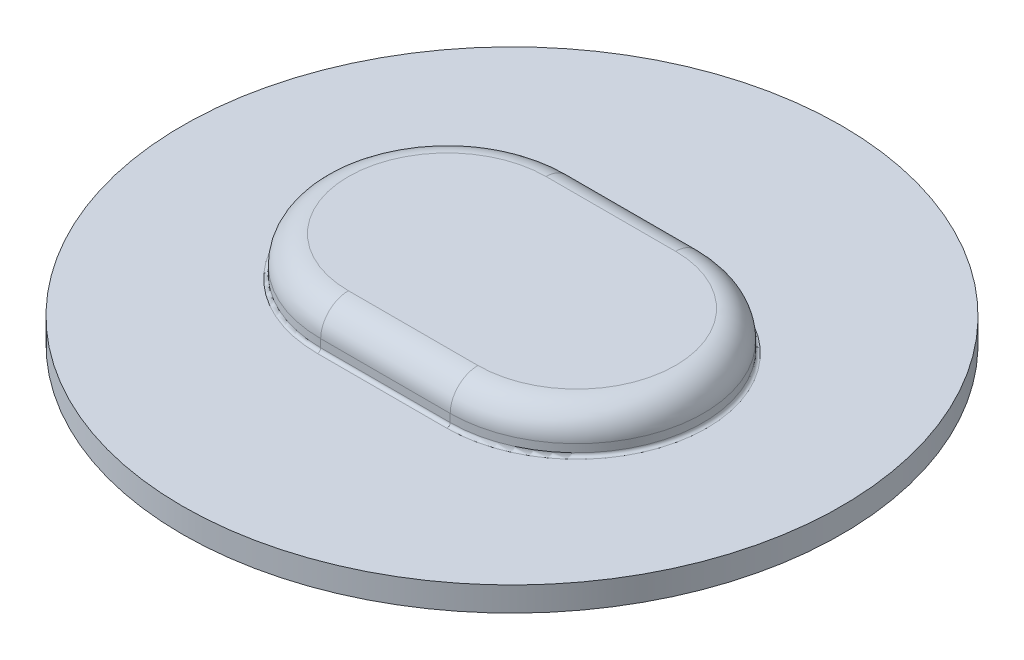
ISO-10303-21;
HEADER;
FILE_DESCRIPTION(('STEP AP214'),'2;1');
FILE_NAME('part.step','',(''),(''),'','','');
FILE_SCHEMA(('AUTOMOTIVE_DESIGN { 1 0 10303 214 1 1 1 1 }'));
ENDSEC;
DATA;
#1=APPLICATION_CONTEXT('core data for automotive mechanical design processes');
#2=APPLICATION_PROTOCOL_DEFINITION('international standard','automotive_design',2000,#1);
#3=PRODUCT_CONTEXT('',#1,'mechanical');
#4=PRODUCT('Part','Part','',(#3));
#5=PRODUCT_RELATED_PRODUCT_CATEGORY('part','',(#4));
#6=PRODUCT_DEFINITION_FORMATION('','',#4);
#7=PRODUCT_DEFINITION_CONTEXT('part definition',#1,'design');
#8=PRODUCT_DEFINITION('design','',#6,#7);
#9=PRODUCT_DEFINITION_SHAPE('','',#8);
#10=(LENGTH_UNIT() NAMED_UNIT(*) SI_UNIT(.MILLI.,.METRE.));
#11=(NAMED_UNIT(*) PLANE_ANGLE_UNIT() SI_UNIT($,.RADIAN.));
#12=(NAMED_UNIT(*) SI_UNIT($,.STERADIAN.) SOLID_ANGLE_UNIT());
#13=UNCERTAINTY_MEASURE_WITH_UNIT(LENGTH_MEASURE(1.E-05),#10,'distance_accuracy_value','');
#14=(GEOMETRIC_REPRESENTATION_CONTEXT(3) GLOBAL_UNCERTAINTY_ASSIGNED_CONTEXT((#13)) GLOBAL_UNIT_ASSIGNED_CONTEXT((#10,
#11,#12)) REPRESENTATION_CONTEXT('',''));
#15=CARTESIAN_POINT('',(0.,0.,0.));
#16=DIRECTION('',(0.,0.,1.));
#17=DIRECTION('',(1.,0.,0.));
#18=AXIS2_PLACEMENT_3D('',#15,#16,#17);
#19=CARTESIAN_POINT('',(0.,1.1176,0.));
#20=DIRECTION('',(0.,1.,0.));
#21=DIRECTION('',(0.,0.,1.));
#22=AXIS2_PLACEMENT_3D('',#19,#20,#21);
#23=PLANE('',#22);
#24=CARTESIAN_POINT('',(-4.9911,1.1176,0.));
#25=DIRECTION('',(0.,1.,0.));
#26=DIRECTION('',(0.,0.,-1.));
#27=AXIS2_PLACEMENT_3D('',#24,#25,#26);
#28=CIRCLE('',#27,7.62);
#29=CARTESIAN_POINT('',(-4.9911,1.1176,7.62));
#30=VERTEX_POINT('',#29);
#31=CARTESIAN_POINT('',(-4.9911,1.1176,-7.62));
#32=VERTEX_POINT('',#31);
#33=EDGE_CURVE('E143',#30,#32,#28,.F.);
#34=ORIENTED_EDGE('',*,*,#33,.T.);
#35=DIRECTION('',(1.,0.,0.));
#36=VECTOR('',#35,1.);
#37=CARTESIAN_POINT('',(0.,1.1176,-7.62));
#38=LINE('',#37,#36);
#39=CARTESIAN_POINT('',(4.9911,1.1176,-7.62));
#40=VERTEX_POINT('',#39);
#41=EDGE_CURVE('E128',#32,#40,#38,.T.);
#42=ORIENTED_EDGE('',*,*,#41,.T.);
#43=CARTESIAN_POINT('',(4.9911,1.1176,0.));
#44=DIRECTION('',(0.,1.,0.));
#45=DIRECTION('',(0.,0.,1.));
#46=AXIS2_PLACEMENT_3D('',#43,#44,#45);
#47=CIRCLE('',#46,7.62);
#48=CARTESIAN_POINT('',(4.9911,1.1176,7.62));
#49=VERTEX_POINT('',#48);
#50=EDGE_CURVE('E218',#40,#49,#47,.F.);
#51=ORIENTED_EDGE('',*,*,#50,.T.);
#52=DIRECTION('',(-1.,0.,0.));
#53=VECTOR('',#52,1.);
#54=CARTESIAN_POINT('',(0.,1.1176,7.62));
#55=LINE('',#54,#53);
#56=EDGE_CURVE('E145',#49,#30,#55,.T.);
#57=ORIENTED_EDGE('',*,*,#56,.T.);
#58=EDGE_LOOP('',(#34,#42,#51,#57));
#59=FACE_BOUND('',#58,.T.);
#60=ADVANCED_FACE('F18',(#59),#23,.F.);
#61=CARTESIAN_POINT('',(-4.9911,0.863599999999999,0.));
#62=DIRECTION('',(0.,1.,0.));
#63=DIRECTION('',(0.,0.,1.));
#64=AXIS2_PLACEMENT_3D('',#61,#62,#63);
#65=TOROIDAL_SURFACE('',#64,7.62,0.254);
#66=ORIENTED_EDGE('',*,*,#33,.F.);
#67=CARTESIAN_POINT('',(-4.9911,0.863599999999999,7.62));
#68=DIRECTION('',(-1.,0.,0.));
#69=DIRECTION('',(0.,0.,1.));
#70=AXIS2_PLACEMENT_3D('',#67,#68,#69);
#71=CIRCLE('',#70,0.254000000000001);
#72=CARTESIAN_POINT('',(-4.9911,0.8636,7.874));
#73=VERTEX_POINT('',#72);
#74=EDGE_CURVE('E227',#30,#73,#71,.F.);
#75=ORIENTED_EDGE('',*,*,#74,.T.);
#76=CARTESIAN_POINT('',(-4.9911,0.8636,0.));
#77=DIRECTION('',(0.,-1.,0.));
#78=DIRECTION('',(0.,0.,-1.));
#79=AXIS2_PLACEMENT_3D('',#76,#77,#78);
#80=CIRCLE('',#79,7.874);
#81=CARTESIAN_POINT('',(-4.9911,0.8636,-7.874));
#82=VERTEX_POINT('',#81);
#83=EDGE_CURVE('E154',#73,#82,#80,.T.);
#84=ORIENTED_EDGE('',*,*,#83,.T.);
#85=CARTESIAN_POINT('',(-4.9911,0.863599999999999,-7.62));
#86=DIRECTION('',(1.,0.,0.));
#87=DIRECTION('',(0.,0.,-1.));
#88=AXIS2_PLACEMENT_3D('',#85,#86,#87);
#89=CIRCLE('',#88,0.254000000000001);
#90=EDGE_CURVE('E133',#82,#32,#89,.T.);
#91=ORIENTED_EDGE('',*,*,#90,.T.);
#92=EDGE_LOOP('',(#66,#75,#84,#91));
#93=FACE_BOUND('',#92,.T.);
#94=ADVANCED_FACE('F153',(#93),#65,.F.);
#95=CARTESIAN_POINT('',(0.,0.863599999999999,7.62));
#96=DIRECTION('',(-1.,0.,0.));
#97=DIRECTION('',(0.,0.,1.));
#98=AXIS2_PLACEMENT_3D('',#95,#96,#97);
#99=CYLINDRICAL_SURFACE('',#98,0.254000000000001);
#100=ORIENTED_EDGE('',*,*,#56,.F.);
#101=CARTESIAN_POINT('',(4.9911,0.863599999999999,7.62));
#102=DIRECTION('',(1.,0.,0.));
#103=DIRECTION('',(0.,0.,1.));
#104=AXIS2_PLACEMENT_3D('',#101,#102,#103);
#105=CIRCLE('',#104,0.254);
#106=CARTESIAN_POINT('',(4.9911,0.863599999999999,7.874));
#107=VERTEX_POINT('',#106);
#108=EDGE_CURVE('E139',#49,#107,#105,.T.);
#109=ORIENTED_EDGE('',*,*,#108,.T.);
#110=DIRECTION('',(-1.,0.,0.));
#111=VECTOR('',#110,1.);
#112=CARTESIAN_POINT('',(-14.7447,0.8636,7.874));
#113=LINE('',#112,#111);
#114=EDGE_CURVE('E172',#73,#107,#113,.F.);
#115=ORIENTED_EDGE('',*,*,#114,.F.);
#116=ORIENTED_EDGE('',*,*,#74,.F.);
#117=EDGE_LOOP('',(#100,#109,#115,#116));
#118=FACE_BOUND('',#117,.T.);
#119=ADVANCED_FACE('F187',(#118),#99,.F.);
#120=CARTESIAN_POINT('',(4.9911,0.863599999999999,0.));
#121=DIRECTION('',(0.,1.,0.));
#122=DIRECTION('',(0.,0.,1.));
#123=AXIS2_PLACEMENT_3D('',#120,#121,#122);
#124=TOROIDAL_SURFACE('',#123,7.62,0.254);
#125=ORIENTED_EDGE('',*,*,#50,.F.);
#126=CARTESIAN_POINT('',(4.99109999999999,0.863599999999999,-7.62));
#127=DIRECTION('',(1.,0.,0.));
#128=DIRECTION('',(0.,0.,-1.));
#129=AXIS2_PLACEMENT_3D('',#126,#127,#128);
#130=CIRCLE('',#129,0.254000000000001);
#131=CARTESIAN_POINT('',(4.99109999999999,0.863599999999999,-7.874));
#132=VERTEX_POINT('',#131);
#133=EDGE_CURVE('E136',#40,#132,#130,.F.);
#134=ORIENTED_EDGE('',*,*,#133,.T.);
#135=CARTESIAN_POINT('',(4.9911,0.863599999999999,0.));
#136=DIRECTION('',(0.,-1.,0.));
#137=DIRECTION('',(0.,0.,-1.));
#138=AXIS2_PLACEMENT_3D('',#135,#136,#137);
#139=CIRCLE('',#138,7.874);
#140=EDGE_CURVE('E168',#132,#107,#139,.T.);
#141=ORIENTED_EDGE('',*,*,#140,.T.);
#142=ORIENTED_EDGE('',*,*,#108,.F.);
#143=EDGE_LOOP('',(#125,#134,#141,#142));
#144=FACE_BOUND('',#143,.T.);
#145=ADVANCED_FACE('F182',(#144),#124,.F.);
#146=CARTESIAN_POINT('',(0.,0.863599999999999,-7.62));
#147=DIRECTION('',(1.,0.,0.));
#148=DIRECTION('',(0.,0.,-1.));
#149=AXIS2_PLACEMENT_3D('',#146,#147,#148);
#150=CYLINDRICAL_SURFACE('',#149,0.254000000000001);
#151=DIRECTION('',(1.,0.,0.));
#152=VECTOR('',#151,1.);
#153=CARTESIAN_POINT('',(-14.7447,0.863599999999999,-7.874));
#154=LINE('',#153,#152);
#155=EDGE_CURVE('E386',#132,#82,#154,.F.);
#156=ORIENTED_EDGE('',*,*,#155,.F.);
#157=ORIENTED_EDGE('',*,*,#133,.F.);
#158=ORIENTED_EDGE('',*,*,#41,.F.);
#159=ORIENTED_EDGE('',*,*,#90,.F.);
#160=EDGE_LOOP('',(#156,#157,#158,#159));
#161=FACE_BOUND('',#160,.T.);
#162=ADVANCED_FACE('F131',(#161),#150,.F.);
#163=CARTESIAN_POINT('',(0.,2.9972,0.));
#164=DIRECTION('',(0.,1.,0.));
#165=DIRECTION('',(0.,0.,1.));
#166=AXIS2_PLACEMENT_3D('',#163,#164,#165);
#167=PLANE('',#166);
#168=DIRECTION('',(1.,0.,0.));
#169=VECTOR('',#168,1.);
#170=CARTESIAN_POINT('',(0.,2.9972,-7.62));
#171=LINE('',#170,#169);
#172=CARTESIAN_POINT('',(-4.9911,2.9972,-7.62));
#173=VERTEX_POINT('',#172);
#174=CARTESIAN_POINT('',(4.9911,2.9972,-7.62));
#175=VERTEX_POINT('',#174);
#176=EDGE_CURVE('E360',#173,#175,#171,.T.);
#177=ORIENTED_EDGE('',*,*,#176,.F.);
#178=CARTESIAN_POINT('',(-4.9911,2.9972,0.));
#179=DIRECTION('',(0.,-1.,0.));
#180=DIRECTION('',(0.,0.,1.));
#181=AXIS2_PLACEMENT_3D('',#178,#179,#180);
#182=CIRCLE('',#181,7.62);
#183=CARTESIAN_POINT('',(-4.9911,2.9972,7.62));
#184=VERTEX_POINT('',#183);
#185=EDGE_CURVE('E294',#184,#173,#182,.T.);
#186=ORIENTED_EDGE('',*,*,#185,.F.);
#187=DIRECTION('',(-1.,0.,0.));
#188=VECTOR('',#187,1.);
#189=CARTESIAN_POINT('',(0.,2.9972,7.62));
#190=LINE('',#189,#188);
#191=CARTESIAN_POINT('',(4.9911,2.9972,7.62));
#192=VERTEX_POINT('',#191);
#193=EDGE_CURVE('E300',#192,#184,#190,.T.);
#194=ORIENTED_EDGE('',*,*,#193,.F.);
#195=CARTESIAN_POINT('',(4.9911,2.9972,0.));
#196=DIRECTION('',(0.,-1.,0.));
#197=DIRECTION('',(0.,0.,-1.));
#198=AXIS2_PLACEMENT_3D('',#195,#196,#197);
#199=CIRCLE('',#198,7.62);
#200=EDGE_CURVE('E263',#175,#192,#199,.T.);
#201=ORIENTED_EDGE('',*,*,#200,.F.);
#202=EDGE_LOOP('',(#177,#186,#194,#201));
#203=FACE_BOUND('',#202,.T.);
#204=ADVANCED_FACE('F270',(#203),#167,.T.);
#205=CARTESIAN_POINT('',(-4.9911,2.9972,0.));
#206=DIRECTION('',(0.,-1.,0.));
#207=DIRECTION('',(0.,0.,-1.));
#208=AXIS2_PLACEMENT_3D('',#205,#206,#207);
#209=CYLINDRICAL_SURFACE('',#208,7.874);
#210=ORIENTED_EDGE('',*,*,#83,.F.);
#211=DIRECTION('',(0.,1.,0.));
#212=VECTOR('',#211,1.);
#213=CARTESIAN_POINT('',(-4.9911,2.9972,7.874));
#214=LINE('',#213,#212);
#215=CARTESIAN_POINT('',(-4.9911,0.254,7.874));
#216=VERTEX_POINT('',#215);
#217=EDGE_CURVE('E157',#216,#73,#214,.T.);
#218=ORIENTED_EDGE('',*,*,#217,.F.);
#219=CARTESIAN_POINT('',(-4.9911,0.254,0.));
#220=DIRECTION('',(0.,-1.,0.));
#221=DIRECTION('',(0.,0.,-1.));
#222=AXIS2_PLACEMENT_3D('',#219,#220,#221);
#223=CIRCLE('',#222,7.874);
#224=CARTESIAN_POINT('',(-4.9911,0.254,-7.874));
#225=VERTEX_POINT('',#224);
#226=EDGE_CURVE('E414',#225,#216,#223,.F.);
#227=ORIENTED_EDGE('',*,*,#226,.F.);
#228=DIRECTION('',(0.,1.,0.));
#229=VECTOR('',#228,1.);
#230=CARTESIAN_POINT('',(-4.9911,2.9972,-7.874));
#231=LINE('',#230,#229);
#232=EDGE_CURVE('E387',#82,#225,#231,.F.);
#233=ORIENTED_EDGE('',*,*,#232,.F.);
#234=EDGE_LOOP('',(#210,#218,#227,#233));
#235=FACE_BOUND('',#234,.T.);
#236=ADVANCED_FACE('F279',(#235),#209,.F.);
#237=CARTESIAN_POINT('',(-14.7447,2.9972,7.874));
#238=DIRECTION('',(0.,0.,-1.));
#239=DIRECTION('',(-1.,0.,0.));
#240=AXIS2_PLACEMENT_3D('',#237,#238,#239);
#241=PLANE('',#240);
#242=DIRECTION('',(0.,-1.,0.));
#243=VECTOR('',#242,1.);
#244=CARTESIAN_POINT('',(4.9911,0.,7.874));
#245=LINE('',#244,#243);
#246=CARTESIAN_POINT('',(4.9911,0.254,7.874));
#247=VERTEX_POINT('',#246);
#248=EDGE_CURVE('E171',#107,#247,#245,.T.);
#249=ORIENTED_EDGE('',*,*,#248,.T.);
#250=DIRECTION('',(-1.,0.,0.));
#251=VECTOR('',#250,1.);
#252=CARTESIAN_POINT('',(-14.7447,0.254,7.874));
#253=LINE('',#252,#251);
#254=EDGE_CURVE('E249',#216,#247,#253,.F.);
#255=ORIENTED_EDGE('',*,*,#254,.F.);
#256=ORIENTED_EDGE('',*,*,#217,.T.);
#257=ORIENTED_EDGE('',*,*,#114,.T.);
#258=EDGE_LOOP('',(#249,#255,#256,#257));
#259=FACE_BOUND('',#258,.T.);
#260=ADVANCED_FACE('F245',(#259),#241,.T.);
#261=CARTESIAN_POINT('',(4.9911,0.,0.));
#262=DIRECTION('',(0.,-1.,0.));
#263=DIRECTION('',(0.,0.,-1.));
#264=AXIS2_PLACEMENT_3D('',#261,#262,#263);
#265=CYLINDRICAL_SURFACE('',#264,7.874);
#266=ORIENTED_EDGE('',*,*,#140,.F.);
#267=DIRECTION('',(0.,1.,0.));
#268=VECTOR('',#267,1.);
#269=CARTESIAN_POINT('',(4.99109999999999,2.9972,-7.874));
#270=LINE('',#269,#268);
#271=CARTESIAN_POINT('',(4.99109999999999,0.253999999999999,-7.874));
#272=VERTEX_POINT('',#271);
#273=EDGE_CURVE('E388',#272,#132,#270,.T.);
#274=ORIENTED_EDGE('',*,*,#273,.F.);
#275=CARTESIAN_POINT('',(4.9911,0.254,0.));
#276=DIRECTION('',(0.,-1.,0.));
#277=DIRECTION('',(0.,0.,-1.));
#278=AXIS2_PLACEMENT_3D('',#275,#276,#277);
#279=CIRCLE('',#278,7.874);
#280=EDGE_CURVE('E401',#247,#272,#279,.F.);
#281=ORIENTED_EDGE('',*,*,#280,.F.);
#282=ORIENTED_EDGE('',*,*,#248,.F.);
#283=EDGE_LOOP('',(#266,#274,#281,#282));
#284=FACE_BOUND('',#283,.T.);
#285=ADVANCED_FACE('F639',(#284),#265,.F.);
#286=CARTESIAN_POINT('',(-14.7447,2.9972,-7.874));
#287=DIRECTION('',(0.,0.,1.));
#288=DIRECTION('',(1.,0.,0.));
#289=AXIS2_PLACEMENT_3D('',#286,#287,#288);
#290=PLANE('',#289);
#291=ORIENTED_EDGE('',*,*,#232,.T.);
#292=DIRECTION('',(1.,0.,0.));
#293=VECTOR('',#292,1.);
#294=CARTESIAN_POINT('',(-14.7447,0.253999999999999,-7.874));
#295=LINE('',#294,#293);
#296=EDGE_CURVE('E480',#272,#225,#295,.F.);
#297=ORIENTED_EDGE('',*,*,#296,.F.);
#298=ORIENTED_EDGE('',*,*,#273,.T.);
#299=ORIENTED_EDGE('',*,*,#155,.T.);
#300=EDGE_LOOP('',(#291,#297,#298,#299));
#301=FACE_BOUND('',#300,.T.);
#302=ADVANCED_FACE('F637',(#301),#290,.T.);
#303=CARTESIAN_POINT('',(0.,0.863599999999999,7.62));
#304=DIRECTION('',(-1.,0.,0.));
#305=DIRECTION('',(0.,0.,1.));
#306=AXIS2_PLACEMENT_3D('',#303,#304,#305);
#307=CYLINDRICAL_SURFACE('',#306,2.1336);
#308=CARTESIAN_POINT('',(4.9911,0.863599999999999,7.62));
#309=DIRECTION('',(1.,0.,0.));
#310=DIRECTION('',(0.,0.,1.));
#311=AXIS2_PLACEMENT_3D('',#308,#309,#310);
#312=CIRCLE('',#311,2.1336);
#313=CARTESIAN_POINT('',(4.9911,0.863599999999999,9.7536));
#314=VERTEX_POINT('',#313);
#315=EDGE_CURVE('E365',#192,#314,#312,.T.);
#316=ORIENTED_EDGE('',*,*,#315,.F.);
#317=ORIENTED_EDGE('',*,*,#193,.T.);
#318=CARTESIAN_POINT('',(-4.9911,0.863599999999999,7.62));
#319=DIRECTION('',(1.,0.,0.));
#320=DIRECTION('',(0.,0.,1.));
#321=AXIS2_PLACEMENT_3D('',#318,#319,#320);
#322=CIRCLE('',#321,2.1336);
#323=CARTESIAN_POINT('',(-4.9911,0.863599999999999,9.7536));
#324=VERTEX_POINT('',#323);
#325=EDGE_CURVE('E332',#324,#184,#322,.F.);
#326=ORIENTED_EDGE('',*,*,#325,.F.);
#327=DIRECTION('',(-1.,0.,0.));
#328=VECTOR('',#327,1.);
#329=CARTESIAN_POINT('',(-14.7447,0.863599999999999,9.7536));
#330=LINE('',#329,#328);
#331=EDGE_CURVE('E325',#324,#314,#330,.F.);
#332=ORIENTED_EDGE('',*,*,#331,.T.);
#333=EDGE_LOOP('',(#316,#317,#326,#332));
#334=FACE_BOUND('',#333,.T.);
#335=ADVANCED_FACE('F371',(#334),#307,.T.);
#336=CARTESIAN_POINT('',(4.9911,0.863599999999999,0.));
#337=DIRECTION('',(0.,1.,0.));
#338=DIRECTION('',(0.,0.,1.));
#339=AXIS2_PLACEMENT_3D('',#336,#337,#338);
#340=TOROIDAL_SURFACE('',#339,7.62,2.1336);
#341=CARTESIAN_POINT('',(4.99109999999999,0.863599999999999,-7.62));
#342=DIRECTION('',(1.,0.,0.));
#343=DIRECTION('',(0.,0.,-1.));
#344=AXIS2_PLACEMENT_3D('',#341,#342,#343);
#345=CIRCLE('',#344,2.1336);
#346=CARTESIAN_POINT('',(4.99109999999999,0.863599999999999,-9.7536));
#347=VERTEX_POINT('',#346);
#348=EDGE_CURVE('E352',#175,#347,#345,.F.);
#349=ORIENTED_EDGE('',*,*,#348,.F.);
#350=ORIENTED_EDGE('',*,*,#200,.T.);
#351=ORIENTED_EDGE('',*,*,#315,.T.);
#352=CARTESIAN_POINT('',(4.9911,0.863599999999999,0.));
#353=DIRECTION('',(0.,-1.,0.));
#354=DIRECTION('',(0.,0.,-1.));
#355=AXIS2_PLACEMENT_3D('',#352,#353,#354);
#356=CIRCLE('',#355,9.7536);
#357=EDGE_CURVE('E348',#347,#314,#356,.T.);
#358=ORIENTED_EDGE('',*,*,#357,.F.);
#359=EDGE_LOOP('',(#349,#350,#351,#358));
#360=FACE_BOUND('',#359,.T.);
#361=ADVANCED_FACE('F367',(#360),#340,.T.);
#362=CARTESIAN_POINT('',(0.,0.863599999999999,-7.62));
#363=DIRECTION('',(1.,0.,0.));
#364=DIRECTION('',(0.,0.,-1.));
#365=AXIS2_PLACEMENT_3D('',#362,#363,#364);
#366=CYLINDRICAL_SURFACE('',#365,2.1336);
#367=ORIENTED_EDGE('',*,*,#348,.T.);
#368=DIRECTION('',(1.,0.,0.));
#369=VECTOR('',#368,1.);
#370=CARTESIAN_POINT('',(-14.7447,0.863599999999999,-9.7536));
#371=LINE('',#370,#369);
#372=CARTESIAN_POINT('',(-4.9911,0.863599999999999,-9.7536));
#373=VERTEX_POINT('',#372);
#374=EDGE_CURVE('E344',#347,#373,#371,.F.);
#375=ORIENTED_EDGE('',*,*,#374,.T.);
#376=CARTESIAN_POINT('',(-4.9911,0.863599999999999,-7.62));
#377=DIRECTION('',(-1.,0.,0.));
#378=DIRECTION('',(0.,0.,-1.));
#379=AXIS2_PLACEMENT_3D('',#376,#377,#378);
#380=CIRCLE('',#379,2.1336);
#381=EDGE_CURVE('E334',#173,#373,#380,.T.);
#382=ORIENTED_EDGE('',*,*,#381,.F.);
#383=ORIENTED_EDGE('',*,*,#176,.T.);
#384=EDGE_LOOP('',(#367,#375,#382,#383));
#385=FACE_BOUND('',#384,.T.);
#386=ADVANCED_FACE('F314',(#385),#366,.T.);
#387=CARTESIAN_POINT('',(-4.9911,0.863599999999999,0.));
#388=DIRECTION('',(0.,1.,0.));
#389=DIRECTION('',(0.,0.,1.));
#390=AXIS2_PLACEMENT_3D('',#387,#388,#389);
#391=TOROIDAL_SURFACE('',#390,7.62,2.1336);
#392=ORIENTED_EDGE('',*,*,#325,.T.);
#393=ORIENTED_EDGE('',*,*,#185,.T.);
#394=ORIENTED_EDGE('',*,*,#381,.T.);
#395=CARTESIAN_POINT('',(-4.9911,0.863599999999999,0.));
#396=DIRECTION('',(0.,-1.,0.));
#397=DIRECTION('',(0.,0.,-1.));
#398=AXIS2_PLACEMENT_3D('',#395,#396,#397);
#399=CIRCLE('',#398,9.7536);
#400=EDGE_CURVE('E337',#324,#373,#399,.T.);
#401=ORIENTED_EDGE('',*,*,#400,.F.);
#402=EDGE_LOOP('',(#392,#393,#394,#401));
#403=FACE_BOUND('',#402,.T.);
#404=ADVANCED_FACE('F302',(#403),#391,.T.);
#405=CARTESIAN_POINT('',(-4.9911,0.254,0.));
#406=DIRECTION('',(0.,-1.,0.));
#407=DIRECTION('',(0.,0.,-1.));
#408=AXIS2_PLACEMENT_3D('',#405,#406,#407);
#409=TOROIDAL_SURFACE('',#408,10.0076,2.1336);
#410=CARTESIAN_POINT('',(-4.9911,0.254,-10.0076));
#411=DIRECTION('',(1.,0.,0.));
#412=DIRECTION('',(0.,0.,-1.));
#413=AXIS2_PLACEMENT_3D('',#410,#411,#412);
#414=CIRCLE('',#413,2.1336);
#415=CARTESIAN_POINT('',(-4.9911,-1.8796,-10.0076));
#416=VERTEX_POINT('',#415);
#417=EDGE_CURVE('E329',#225,#416,#414,.T.);
#418=ORIENTED_EDGE('',*,*,#417,.F.);
#419=ORIENTED_EDGE('',*,*,#226,.T.);
#420=CARTESIAN_POINT('',(-4.9911,0.254,10.0076));
#421=DIRECTION('',(-1.,0.,0.));
#422=DIRECTION('',(0.,0.,1.));
#423=AXIS2_PLACEMENT_3D('',#420,#421,#422);
#424=CIRCLE('',#423,2.1336);
#425=CARTESIAN_POINT('',(-4.9911,-1.8796,10.0076));
#426=VERTEX_POINT('',#425);
#427=EDGE_CURVE('E408',#426,#216,#424,.F.);
#428=ORIENTED_EDGE('',*,*,#427,.F.);
#429=CARTESIAN_POINT('',(-4.9911,-1.8796,0.));
#430=DIRECTION('',(0.,-1.,0.));
#431=DIRECTION('',(0.,0.,1.));
#432=AXIS2_PLACEMENT_3D('',#429,#430,#431);
#433=CIRCLE('',#432,10.0076);
#434=EDGE_CURVE('E340',#416,#426,#433,.F.);
#435=ORIENTED_EDGE('',*,*,#434,.F.);
#436=EDGE_LOOP('',(#418,#419,#428,#435));
#437=FACE_BOUND('',#436,.T.);
#438=ADVANCED_FACE('F313',(#437),#409,.T.);
#439=CARTESIAN_POINT('',(-14.7447,0.254,10.0076));
#440=DIRECTION('',(-1.,0.,0.));
#441=DIRECTION('',(0.,0.,1.));
#442=AXIS2_PLACEMENT_3D('',#439,#440,#441);
#443=CYLINDRICAL_SURFACE('',#442,2.1336);
#444=CARTESIAN_POINT('',(4.9911,0.254,10.0076));
#445=DIRECTION('',(-1.,0.,0.));
#446=DIRECTION('',(0.,0.,1.));
#447=AXIS2_PLACEMENT_3D('',#444,#445,#446);
#448=CIRCLE('',#447,2.1336);
#449=CARTESIAN_POINT('',(4.9911,-1.8796,10.0076));
#450=VERTEX_POINT('',#449);
#451=EDGE_CURVE('E404',#450,#247,#448,.F.);
#452=ORIENTED_EDGE('',*,*,#451,.F.);
#453=DIRECTION('',(1.,0.,0.));
#454=VECTOR('',#453,1.);
#455=CARTESIAN_POINT('',(0.,-1.8796,10.0076));
#456=LINE('',#455,#454);
#457=EDGE_CURVE('E430',#426,#450,#456,.T.);
#458=ORIENTED_EDGE('',*,*,#457,.F.);
#459=ORIENTED_EDGE('',*,*,#427,.T.);
#460=ORIENTED_EDGE('',*,*,#254,.T.);
#461=EDGE_LOOP('',(#452,#458,#459,#460));
#462=FACE_BOUND('',#461,.T.);
#463=ADVANCED_FACE('F496',(#462),#443,.T.);
#464=CARTESIAN_POINT('',(4.9911,0.254,0.));
#465=DIRECTION('',(0.,-1.,0.));
#466=DIRECTION('',(0.,0.,-1.));
#467=AXIS2_PLACEMENT_3D('',#464,#465,#466);
#468=TOROIDAL_SURFACE('',#467,10.0076,2.1336);
#469=CARTESIAN_POINT('',(4.99109999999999,0.254,-10.0076));
#470=DIRECTION('',(1.,0.,0.));
#471=DIRECTION('',(0.,0.,-1.));
#472=AXIS2_PLACEMENT_3D('',#469,#470,#471);
#473=CIRCLE('',#472,2.1336);
#474=CARTESIAN_POINT('',(4.99109999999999,-1.8796,-10.0076));
#475=VERTEX_POINT('',#474);
#476=EDGE_CURVE('E403',#475,#272,#473,.F.);
#477=ORIENTED_EDGE('',*,*,#476,.F.);
#478=CARTESIAN_POINT('',(4.9911,-1.8796,0.));
#479=DIRECTION('',(0.,-1.,0.));
#480=DIRECTION('',(0.,0.,-1.));
#481=AXIS2_PLACEMENT_3D('',#478,#479,#480);
#482=CIRCLE('',#481,10.0076);
#483=EDGE_CURVE('E431',#450,#475,#482,.F.);
#484=ORIENTED_EDGE('',*,*,#483,.F.);
#485=ORIENTED_EDGE('',*,*,#451,.T.);
#486=ORIENTED_EDGE('',*,*,#280,.T.);
#487=EDGE_LOOP('',(#477,#484,#485,#486));
#488=FACE_BOUND('',#487,.T.);
#489=ADVANCED_FACE('F491',(#488),#468,.T.);
#490=CARTESIAN_POINT('',(-14.7447,0.254,-10.0076));
#491=DIRECTION('',(1.,0.,0.));
#492=DIRECTION('',(0.,0.,-1.));
#493=AXIS2_PLACEMENT_3D('',#490,#491,#492);
#494=CYLINDRICAL_SURFACE('',#493,2.1336);
#495=ORIENTED_EDGE('',*,*,#417,.T.);
#496=DIRECTION('',(1.,0.,0.));
#497=VECTOR('',#496,1.);
#498=CARTESIAN_POINT('',(0.,-1.8796,-10.0076));
#499=LINE('',#498,#497);
#500=EDGE_CURVE('E433',#475,#416,#499,.F.);
#501=ORIENTED_EDGE('',*,*,#500,.F.);
#502=ORIENTED_EDGE('',*,*,#476,.T.);
#503=ORIENTED_EDGE('',*,*,#296,.T.);
#504=EDGE_LOOP('',(#495,#501,#502,#503));
#505=FACE_BOUND('',#504,.T.);
#506=ADVANCED_FACE('F495',(#505),#494,.T.);
#507=CARTESIAN_POINT('',(-14.7447,2.9972,9.7536));
#508=DIRECTION('',(0.,0.,-1.));
#509=DIRECTION('',(-1.,0.,0.));
#510=AXIS2_PLACEMENT_3D('',#507,#508,#509);
#511=PLANE('',#510);
#512=DIRECTION('',(-1.,0.,0.));
#513=VECTOR('',#512,1.);
#514=CARTESIAN_POINT('',(-14.7447,0.254,9.7536));
#515=LINE('',#514,#513);
#516=CARTESIAN_POINT('',(-4.9911,0.254,9.7536));
#517=VERTEX_POINT('',#516);
#518=CARTESIAN_POINT('',(4.9911,0.254,9.7536));
#519=VERTEX_POINT('',#518);
#520=EDGE_CURVE('E440',#517,#519,#515,.F.);
#521=ORIENTED_EDGE('',*,*,#520,.T.);
#522=DIRECTION('',(0.,-1.,0.));
#523=VECTOR('',#522,1.);
#524=CARTESIAN_POINT('',(4.9911,0.,9.7536));
#525=LINE('',#524,#523);
#526=EDGE_CURVE('E328',#314,#519,#525,.T.);
#527=ORIENTED_EDGE('',*,*,#526,.F.);
#528=ORIENTED_EDGE('',*,*,#331,.F.);
#529=DIRECTION('',(0.,-1.,0.));
#530=VECTOR('',#529,1.);
#531=CARTESIAN_POINT('',(-4.9911,2.9972,9.7536));
#532=LINE('',#531,#530);
#533=EDGE_CURVE('E341',#517,#324,#532,.F.);
#534=ORIENTED_EDGE('',*,*,#533,.F.);
#535=EDGE_LOOP('',(#521,#527,#528,#534));
#536=FACE_BOUND('',#535,.T.);
#537=ADVANCED_FACE('F761',(#536),#511,.F.);
#538=CARTESIAN_POINT('',(4.9911,0.,0.));
#539=DIRECTION('',(0.,-1.,0.));
#540=DIRECTION('',(0.,0.,-1.));
#541=AXIS2_PLACEMENT_3D('',#538,#539,#540);
#542=CYLINDRICAL_SURFACE('',#541,9.7536);
#543=DIRECTION('',(0.,1.,0.));
#544=VECTOR('',#543,1.);
#545=CARTESIAN_POINT('',(4.99109999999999,2.9972,-9.7536));
#546=LINE('',#545,#544);
#547=CARTESIAN_POINT('',(4.99109999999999,0.254,-9.7536));
#548=VERTEX_POINT('',#547);
#549=EDGE_CURVE('E347',#548,#347,#546,.T.);
#550=ORIENTED_EDGE('',*,*,#549,.T.);
#551=ORIENTED_EDGE('',*,*,#357,.T.);
#552=ORIENTED_EDGE('',*,*,#526,.T.);
#553=CARTESIAN_POINT('',(4.9911,0.254,0.));
#554=DIRECTION('',(0.,-1.,0.));
#555=DIRECTION('',(0.,0.,-1.));
#556=AXIS2_PLACEMENT_3D('',#553,#554,#555);
#557=CIRCLE('',#556,9.7536);
#558=EDGE_CURVE('E443',#519,#548,#557,.F.);
#559=ORIENTED_EDGE('',*,*,#558,.T.);
#560=EDGE_LOOP('',(#550,#551,#552,#559));
#561=FACE_BOUND('',#560,.T.);
#562=ADVANCED_FACE('F768',(#561),#542,.T.);
#563=CARTESIAN_POINT('',(-14.7447,2.9972,-9.7536));
#564=DIRECTION('',(0.,0.,1.));
#565=DIRECTION('',(1.,0.,0.));
#566=AXIS2_PLACEMENT_3D('',#563,#564,#565);
#567=PLANE('',#566);
#568=DIRECTION('',(1.,0.,0.));
#569=VECTOR('',#568,1.);
#570=CARTESIAN_POINT('',(-14.7447,0.254,-9.7536));
#571=LINE('',#570,#569);
#572=CARTESIAN_POINT('',(-4.9911,0.254,-9.7536));
#573=VERTEX_POINT('',#572);
#574=EDGE_CURVE('E460',#548,#573,#571,.F.);
#575=ORIENTED_EDGE('',*,*,#574,.T.);
#576=DIRECTION('',(0.,-1.,0.));
#577=VECTOR('',#576,1.);
#578=CARTESIAN_POINT('',(-4.9911,2.9972,-9.7536));
#579=LINE('',#578,#577);
#580=EDGE_CURVE('E454',#373,#573,#579,.T.);
#581=ORIENTED_EDGE('',*,*,#580,.F.);
#582=ORIENTED_EDGE('',*,*,#374,.F.);
#583=ORIENTED_EDGE('',*,*,#549,.F.);
#584=EDGE_LOOP('',(#575,#581,#582,#583));
#585=FACE_BOUND('',#584,.T.);
#586=ADVANCED_FACE('F776',(#585),#567,.F.);
#587=CARTESIAN_POINT('',(-4.9911,2.9972,0.));
#588=DIRECTION('',(0.,-1.,0.));
#589=DIRECTION('',(0.,0.,-1.));
#590=AXIS2_PLACEMENT_3D('',#587,#588,#589);
#591=CYLINDRICAL_SURFACE('',#590,9.7536);
#592=ORIENTED_EDGE('',*,*,#533,.T.);
#593=ORIENTED_EDGE('',*,*,#400,.T.);
#594=ORIENTED_EDGE('',*,*,#580,.T.);
#595=CARTESIAN_POINT('',(-4.9911,0.254,0.));
#596=DIRECTION('',(0.,-1.,0.));
#597=DIRECTION('',(0.,0.,-1.));
#598=AXIS2_PLACEMENT_3D('',#595,#596,#597);
#599=CIRCLE('',#598,9.7536);
#600=EDGE_CURVE('E446',#573,#517,#599,.F.);
#601=ORIENTED_EDGE('',*,*,#600,.T.);
#602=EDGE_LOOP('',(#592,#593,#594,#601));
#603=FACE_BOUND('',#602,.T.);
#604=ADVANCED_FACE('F621',(#603),#591,.T.);
#605=CARTESIAN_POINT('',(0.,-1.8796,0.));
#606=DIRECTION('',(0.,-1.,0.));
#607=DIRECTION('',(0.,0.,-1.));
#608=AXIS2_PLACEMENT_3D('',#605,#606,#607);
#609=PLANE('',#608);
#610=CARTESIAN_POINT('',(0.,-1.8796,0.));
#611=DIRECTION('',(0.,-1.,0.));
#612=DIRECTION('',(0.,0.,-1.));
#613=AXIS2_PLACEMENT_3D('',#610,#611,#612);
#614=CIRCLE('',#613,25.4);
#615=CARTESIAN_POINT('',(0.,-1.8796,-25.4));
#616=VERTEX_POINT('',#615);
#617=EDGE_CURVE('E22',#616,#616,#614,.F.);
#618=ORIENTED_EDGE('',*,*,#617,.F.);
#619=EDGE_LOOP('',(#618));
#620=FACE_BOUND('',#619,.T.);
#621=ORIENTED_EDGE('',*,*,#483,.T.);
#622=ORIENTED_EDGE('',*,*,#500,.T.);
#623=ORIENTED_EDGE('',*,*,#434,.T.);
#624=ORIENTED_EDGE('',*,*,#457,.T.);
#625=EDGE_LOOP('',(#621,#622,#623,#624));
#626=FACE_BOUND('',#625,.T.);
#627=ADVANCED_FACE('F612',(#620,#626),#609,.T.);
#628=CARTESIAN_POINT('',(-14.7447,0.254,10.0076));
#629=DIRECTION('',(-1.,0.,0.));
#630=DIRECTION('',(0.,0.,1.));
#631=AXIS2_PLACEMENT_3D('',#628,#629,#630);
#632=CYLINDRICAL_SURFACE('',#631,0.254000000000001);
#633=DIRECTION('',(1.,0.,0.));
#634=VECTOR('',#633,1.);
#635=CARTESIAN_POINT('',(0.,0.,10.0076));
#636=LINE('',#635,#634);
#637=CARTESIAN_POINT('',(-4.9911,0.,10.0076));
#638=VERTEX_POINT('',#637);
#639=CARTESIAN_POINT('',(4.9911,0.,10.0076));
#640=VERTEX_POINT('',#639);
#641=EDGE_CURVE('E548',#638,#640,#636,.T.);
#642=ORIENTED_EDGE('',*,*,#641,.T.);
#643=CARTESIAN_POINT('',(4.9911,0.254,10.0076));
#644=DIRECTION('',(-1.,0.,0.));
#645=DIRECTION('',(0.,0.,1.));
#646=AXIS2_PLACEMENT_3D('',#643,#644,#645);
#647=CIRCLE('',#646,0.254);
#648=EDGE_CURVE('E464',#640,#519,#647,.F.);
#649=ORIENTED_EDGE('',*,*,#648,.T.);
#650=ORIENTED_EDGE('',*,*,#520,.F.);
#651=CARTESIAN_POINT('',(-4.9911,0.254,10.0076));
#652=DIRECTION('',(-1.,0.,0.));
#653=DIRECTION('',(0.,0.,1.));
#654=AXIS2_PLACEMENT_3D('',#651,#652,#653);
#655=CIRCLE('',#654,0.254);
#656=EDGE_CURVE('E449',#517,#638,#655,.T.);
#657=ORIENTED_EDGE('',*,*,#656,.T.);
#658=EDGE_LOOP('',(#642,#649,#650,#657));
#659=FACE_BOUND('',#658,.T.);
#660=ADVANCED_FACE('F593',(#659),#632,.F.);
#661=CARTESIAN_POINT('',(4.9911,0.254,0.));
#662=DIRECTION('',(0.,-1.,0.));
#663=DIRECTION('',(0.,0.,-1.));
#664=AXIS2_PLACEMENT_3D('',#661,#662,#663);
#665=TOROIDAL_SURFACE('',#664,10.0076,0.254);
#666=CARTESIAN_POINT('',(4.9911,0.,0.));
#667=DIRECTION('',(0.,1.,0.));
#668=DIRECTION('',(0.,0.,1.));
#669=AXIS2_PLACEMENT_3D('',#666,#667,#668);
#670=CIRCLE('',#669,10.0076);
#671=CARTESIAN_POINT('',(4.99109999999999,0.,-10.0076));
#672=VERTEX_POINT('',#671);
#673=EDGE_CURVE('E556',#640,#672,#670,.T.);
#674=ORIENTED_EDGE('',*,*,#673,.T.);
#675=CARTESIAN_POINT('',(4.99109999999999,0.254,-10.0076));
#676=DIRECTION('',(1.,0.,0.));
#677=DIRECTION('',(0.,0.,-1.));
#678=AXIS2_PLACEMENT_3D('',#675,#676,#677);
#679=CIRCLE('',#678,0.254000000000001);
#680=EDGE_CURVE('E463',#672,#548,#679,.F.);
#681=ORIENTED_EDGE('',*,*,#680,.T.);
#682=ORIENTED_EDGE('',*,*,#558,.F.);
#683=ORIENTED_EDGE('',*,*,#648,.F.);
#684=EDGE_LOOP('',(#674,#681,#682,#683));
#685=FACE_BOUND('',#684,.T.);
#686=ADVANCED_FACE('F589',(#685),#665,.F.);
#687=CARTESIAN_POINT('',(-14.7447,0.254,-10.0076));
#688=DIRECTION('',(1.,0.,0.));
#689=DIRECTION('',(0.,0.,-1.));
#690=AXIS2_PLACEMENT_3D('',#687,#688,#689);
#691=CYLINDRICAL_SURFACE('',#690,0.254000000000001);
#692=DIRECTION('',(1.,0.,0.));
#693=VECTOR('',#692,1.);
#694=CARTESIAN_POINT('',(0.,0.,-10.0076));
#695=LINE('',#694,#693);
#696=CARTESIAN_POINT('',(-4.9911,0.,-10.0076));
#697=VERTEX_POINT('',#696);
#698=EDGE_CURVE('E545',#672,#697,#695,.F.);
#699=ORIENTED_EDGE('',*,*,#698,.T.);
#700=CARTESIAN_POINT('',(-4.9911,0.254,-10.0076));
#701=DIRECTION('',(1.,0.,0.));
#702=DIRECTION('',(0.,0.,-1.));
#703=AXIS2_PLACEMENT_3D('',#700,#701,#702);
#704=CIRCLE('',#703,0.254);
#705=EDGE_CURVE('E36',#697,#573,#704,.F.);
#706=ORIENTED_EDGE('',*,*,#705,.T.);
#707=ORIENTED_EDGE('',*,*,#574,.F.);
#708=ORIENTED_EDGE('',*,*,#680,.F.);
#709=EDGE_LOOP('',(#699,#706,#707,#708));
#710=FACE_BOUND('',#709,.T.);
#711=ADVANCED_FACE('F553',(#710),#691,.F.);
#712=CARTESIAN_POINT('',(-4.9911,0.254,0.));
#713=DIRECTION('',(0.,-1.,0.));
#714=DIRECTION('',(0.,0.,-1.));
#715=AXIS2_PLACEMENT_3D('',#712,#713,#714);
#716=TOROIDAL_SURFACE('',#715,10.0076,0.254);
#717=ORIENTED_EDGE('',*,*,#600,.F.);
#718=ORIENTED_EDGE('',*,*,#705,.F.);
#719=CARTESIAN_POINT('',(-4.9911,0.,0.));
#720=DIRECTION('',(0.,1.,0.));
#721=DIRECTION('',(0.,0.,-1.));
#722=AXIS2_PLACEMENT_3D('',#719,#720,#721);
#723=CIRCLE('',#722,10.0076);
#724=EDGE_CURVE('E28',#697,#638,#723,.T.);
#725=ORIENTED_EDGE('',*,*,#724,.T.);
#726=ORIENTED_EDGE('',*,*,#656,.F.);
#727=EDGE_LOOP('',(#717,#718,#725,#726));
#728=FACE_BOUND('',#727,.T.);
#729=ADVANCED_FACE('F519',(#728),#716,.F.);
#730=CARTESIAN_POINT('',(0.,0.,0.));
#731=DIRECTION('',(0.,-1.,0.));
#732=DIRECTION('',(0.,0.,-1.));
#733=AXIS2_PLACEMENT_3D('',#730,#731,#732);
#734=CYLINDRICAL_SURFACE('',#733,25.4);
#735=ORIENTED_EDGE('',*,*,#617,.T.);
#736=EDGE_LOOP('',(#735));
#737=FACE_BOUND('',#736,.T.);
#738=CARTESIAN_POINT('',(0.,0.,0.));
#739=DIRECTION('',(0.,-1.,0.));
#740=DIRECTION('',(0.,0.,-1.));
#741=AXIS2_PLACEMENT_3D('',#738,#739,#740);
#742=CIRCLE('',#741,25.4);
#743=CARTESIAN_POINT('',(0.,0.,-25.4));
#744=VERTEX_POINT('',#743);
#745=EDGE_CURVE('E11',#744,#744,#742,.T.);
#746=ORIENTED_EDGE('',*,*,#745,.T.);
#747=EDGE_LOOP('',(#746));
#748=FACE_BOUND('',#747,.T.);
#749=ADVANCED_FACE('F513',(#737,#748),#734,.T.);
#750=CARTESIAN_POINT('',(0.,0.,0.));
#751=DIRECTION('',(0.,-1.,0.));
#752=DIRECTION('',(0.,0.,-1.));
#753=AXIS2_PLACEMENT_3D('',#750,#751,#752);
#754=PLANE('',#753);
#755=ORIENTED_EDGE('',*,*,#745,.F.);
#756=EDGE_LOOP('',(#755));
#757=FACE_BOUND('',#756,.T.);
#758=ORIENTED_EDGE('',*,*,#698,.F.);
#759=ORIENTED_EDGE('',*,*,#673,.F.);
#760=ORIENTED_EDGE('',*,*,#641,.F.);
#761=ORIENTED_EDGE('',*,*,#724,.F.);
#762=EDGE_LOOP('',(#758,#759,#760,#761));
#763=FACE_BOUND('',#762,.T.);
#764=ADVANCED_FACE('F511',(#757,#763),#754,.F.);
#765=CLOSED_SHELL('',(#60,#94,#119,#145,#162,#204,#236,#260,#285,#302,#335,#361,#386,#404,#438,
#463,#489,#506,#537,#562,#586,#604,#627,#660,#686,#711,#729,#749,#764));
#766=MANIFOLD_SOLID_BREP('B1',#765);
#767=ADVANCED_BREP_SHAPE_REPRESENTATION('',(#18,#766),#14);
#768=SHAPE_DEFINITION_REPRESENTATION(#9,#767);
ENDSEC;
END-ISO-10303-21;
